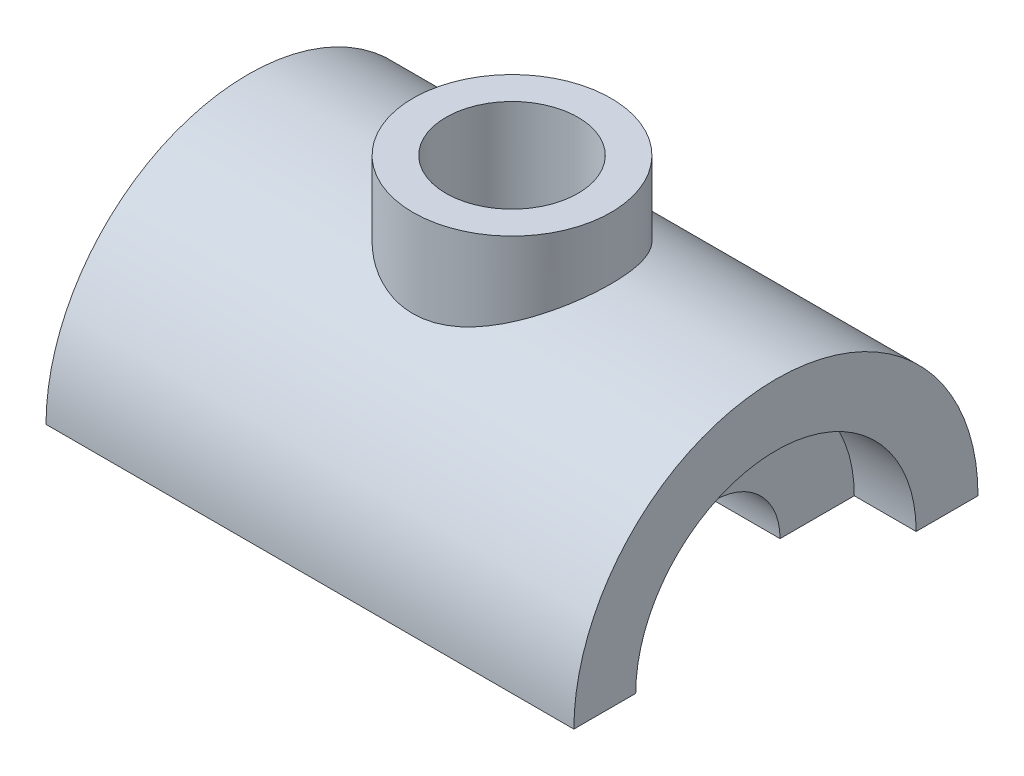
from build123d import *

# Parameters (mm, degrees)
EXTRUDE_1_DEPTH      = 128
EXTRUDE_1_DEPTH_BACK = 128
EXTRUDE_2_DEPTH      = 98
EXTRUDE_2_DEPTH_BACK = 98
EXTRUDE_3_REACH      = 207.845
EXTRUDE_3_END_RADIUS = 98
SKETCH_2_R           = 48
SKETCH_3_R           = 32
CUT_EXTRUDE_1_DEPTH  = 206.844601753


with BuildPart() as part:
    # Sketch 1 → Extrude 1 (new, two sides: drawn at the far end of the back side and taken through both)
    with BuildSketch(Plane(origin=(0, 0, 0), x_dir=(0, 0, -1), z_dir=(1, 0, 0)).offset(-EXTRUDE_1_DEPTH_BACK)):
        with BuildLine():
            Line((68, 0), (98, 0))
            ThreePointArc((98, 0), (0, 98), (-98, 0))
            Line((-98, 0), (-68, 0))
            ThreePointArc((-68, 0), (0, 68), (68, 0))
        make_face()
    extrude(amount=EXTRUDE_1_DEPTH + EXTRUDE_1_DEPTH_BACK)

    # Sketch 1_3 → Extrude 2 (add, two sides: drawn at the far end of the back side and taken through both)
    with BuildSketch(Plane(origin=(0, 0, 0), x_dir=(0, 0, -1), z_dir=(1, 0, 0)).offset(-EXTRUDE_2_DEPTH_BACK)):
        with BuildLine():
            Line((32, 0), (68, 0))
            ThreePointArc((68, 0), (0, 68), (-68, 0))
            Line((-68, 0), (-32, 0))
            ThreePointArc((-32, 0), (0, 32), (32, 0))
        make_face()
    extrude(amount=EXTRUDE_2_DEPTH + EXTRUDE_2_DEPTH_BACK)

    # Extrude 3: up to this cylinder (the profile starts outside it)
    extrude_3_end = Plane(origin=(0, 0, 0), z_dir=(1, 0, 0)) * Cylinder(EXTRUDE_3_END_RADIUS, 612.69, mode=Mode.PRIVATE)
    # Sketch 2 → Extrude 3 (add, up to the surface)
    with BuildSketch(Plane(origin=(0, 128, 0), x_dir=(-1, 0, 0), z_dir=(0, 1, 0)), mode=Mode.PRIVATE) as extrude_3_sk1:
        with Locations(Location((0, 0, 0), (0, 0, 90))):
            Circle(SKETCH_2_R)
    extrude_3_tool1 = extrude(extrude_3_sk1.sketch, amount=-EXTRUDE_3_REACH, mode=Mode.PRIVATE) - extrude_3_end
    add(extrude_3_tool1.solids().sort_by_distance((0, 128, 0))[0])

    # Sketch 3 → Cut-Extrude 1 (cut, through all)
    with BuildSketch(Plane(origin=(0, 128, 0), x_dir=(1, 0, 0), z_dir=(0, 1, 0))):
        with Locations(Location((0, 0, 0), (0, 0, 270))):
            Circle(SKETCH_3_R)
    extrude(amount=-CUT_EXTRUDE_1_DEPTH, mode=Mode.SUBTRACT)


solid = part.part
